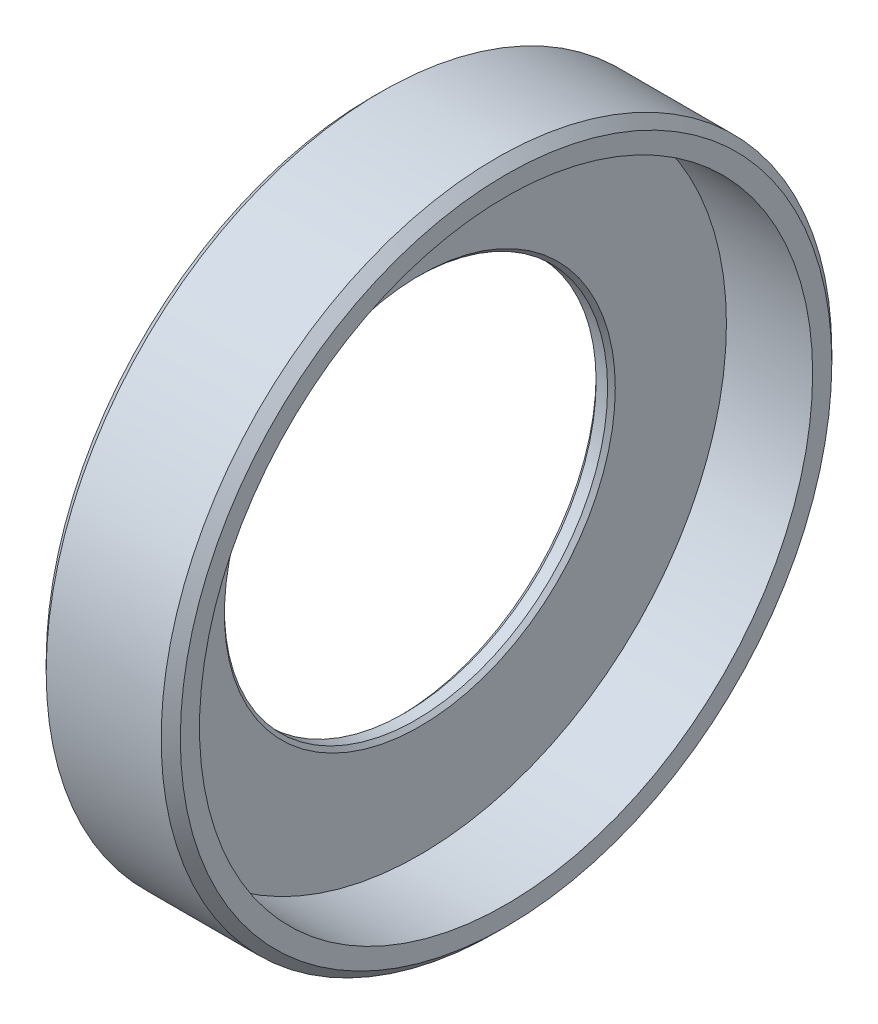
from build123d import *
from OCP.BRepFilletAPI import BRepFilletAPI_MakeChamfer

# Parameters (mm, degrees)
CHAMFER1_SIZE  = 0.5
CHAMFER2_SIZE  = 0.2
CHAMFER2_SIZE2 = 0.298294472


with BuildPart() as part:
    # Sketch1 → Revolve1 (revolve)
    with BuildSketch(Plane(origin=(0, 0, 0), x_dir=(1, 0, 0), z_dir=(0, 1, 0))):
        Polygon((0, 17.5), (0, 15), (1.5, 10), (2.5, 10), (2.5, 16), (7, 16), (7, 17.5), align=None)
    revolve(axis=Axis((0, 0, 0), (-1, 0, 0)))

    # Chamfer1
    chamfer1_edges = [part.edges().sort_by_distance(p)[0] for p in [
        (7, 0, 17.5),
        (0, 0, 17.5),
    ]]
    chamfer(chamfer1_edges, length=CHAMFER1_SIZE)

    # Chamfer2: one chamfer whose edges measure the first distance from different faces: ONE call of the kernel's chamfer builder (chamfer() names one face for all edges)
    chamfer2_edges_1 = [part.edges().sort_by_distance(p)[0] for p in [
        (2.5, 0, 10),
    ]]
    chamfer2_edges_2 = [part.edges().sort_by_distance(p)[0] for p in [
        (1.5, 0, 10),
    ]]
    chamfer2_side_2 = [part.faces().sort_by_distance(p)[0] for p in [
        (2, 0, 10),
    ]]
    chamfer2 = BRepFilletAPI_MakeChamfer(part.part.solid().wrapped)
    for e in chamfer2_edges_1:
        chamfer2.Add(CHAMFER2_SIZE, e.wrapped)
    for e in chamfer2_edges_2:
        chamfer2.Add(CHAMFER2_SIZE, CHAMFER2_SIZE2, e.wrapped, chamfer2_side_2[0].wrapped)  # the first distance lies on this face
    add(Compound.cast(chamfer2.Shape()), mode=Mode.REPLACE)


solid = part.part
